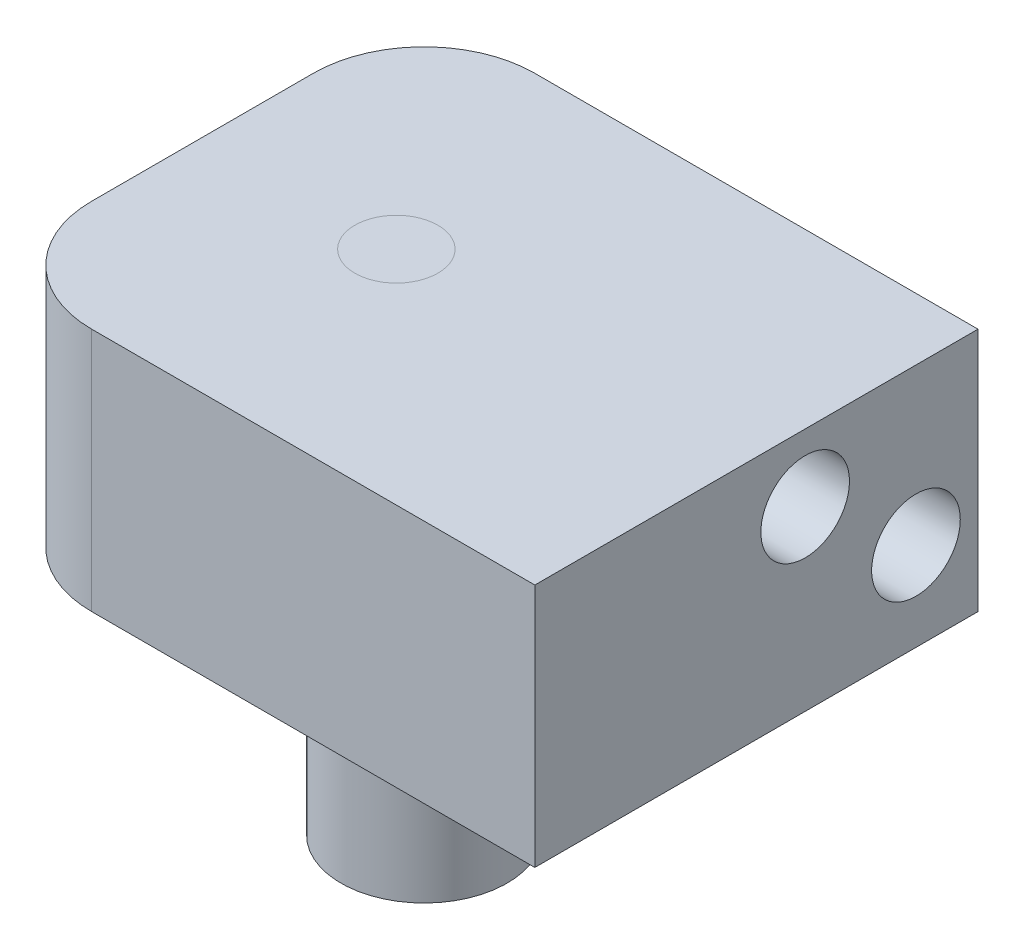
from build123d import *

# Parameters (mm, degrees)
SKETCH1_W           = 31.75
SKETCH1_H           = 14.0208
BASE_EXTRUDE_DEPTH  = 25.4
SKETCH2_R           = 8.255
BOSS_EXTRUDE1_DEPTH = 1.27
SKETCH3_R           = 4.7625
BOSS_EXTRUDE2_DEPTH = 13.0048
FILLET3_R           = 6.35
SKETCH4_R           = 2.54
EXTRUDE1_DEPTH      = 10


with BuildPart() as part:
    # Sketch1 → Base-Extrude (new body)
    with BuildSketch(Plane.XY):
        with Locations((15.875, 7.0104)):
            Rectangle(SKETCH1_W, SKETCH1_H)
    extrude(amount=BASE_EXTRUDE_DEPTH)

    # Sketch2 → Boss-Extrude1 (add)
    with BuildSketch(Plane.XZ):
        with Locations(Location((12.7, 12.7, 0), (0, 0, 90))):
            Circle(SKETCH2_R)
    extrude(amount=BOSS_EXTRUDE1_DEPTH)

    # Sketch3 → Boss-Extrude2 (add)
    with BuildSketch(Plane.XZ.offset(1.27)):
        with Locations(Location((12.7, 12.7, 0), (0, 0, 270))):
            Circle(SKETCH3_R)
    extrude(amount=BOSS_EXTRUDE2_DEPTH)

    # Fillet3
    fillet3_edges = [part.edges().sort_by_distance(p)[0] for p in [
        (0, 7.0104, 25.4),
        (0, 7.0104, 0),
    ]]
    fillet(fillet3_edges, radius=FILLET3_R)

    # Sketch4 → Extrude1 (cut)
    with BuildSketch(Plane(origin=(31.75, 0, 0), x_dir=(0, 0, -1), z_dir=(1, 0, 0))):
        with Locations((-9.906, 10.16)):
            Circle(SKETCH4_R)
        with Locations((-3.556, 5.08)):
            Circle(SKETCH4_R)
    extrude(amount=-EXTRUDE1_DEPTH, mode=Mode.SUBTRACT)


solid = part.part
